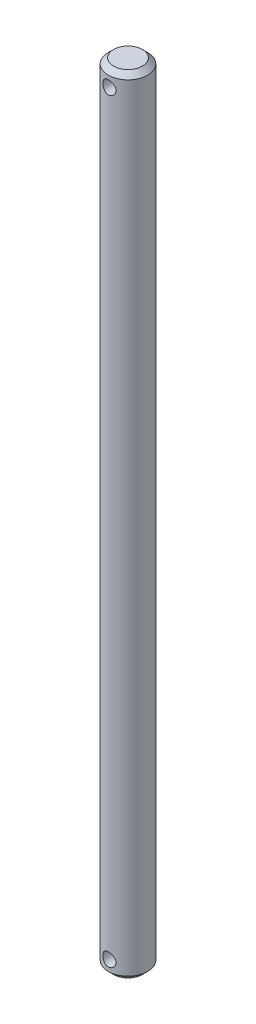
ISO-10303-21;
HEADER;
FILE_DESCRIPTION(('STEP AP214'),'2;1');
FILE_NAME('part.step','',(''),(''),'','','');
FILE_SCHEMA(('AUTOMOTIVE_DESIGN { 1 0 10303 214 1 1 1 1 }'));
ENDSEC;
DATA;
#1=APPLICATION_CONTEXT('core data for automotive mechanical design processes');
#2=APPLICATION_PROTOCOL_DEFINITION('international standard','automotive_design',2000,#1);
#3=PRODUCT_CONTEXT('',#1,'mechanical');
#4=PRODUCT('Part','Part','',(#3));
#5=PRODUCT_RELATED_PRODUCT_CATEGORY('part','',(#4));
#6=PRODUCT_DEFINITION_FORMATION('','',#4);
#7=PRODUCT_DEFINITION_CONTEXT('part definition',#1,'design');
#8=PRODUCT_DEFINITION('design','',#6,#7);
#9=PRODUCT_DEFINITION_SHAPE('','',#8);
#10=(LENGTH_UNIT() NAMED_UNIT(*) SI_UNIT(.MILLI.,.METRE.));
#11=(NAMED_UNIT(*) PLANE_ANGLE_UNIT() SI_UNIT($,.RADIAN.));
#12=(NAMED_UNIT(*) SI_UNIT($,.STERADIAN.) SOLID_ANGLE_UNIT());
#13=UNCERTAINTY_MEASURE_WITH_UNIT(LENGTH_MEASURE(1.E-05),#10,'distance_accuracy_value','');
#14=(GEOMETRIC_REPRESENTATION_CONTEXT(3) GLOBAL_UNCERTAINTY_ASSIGNED_CONTEXT((#13)) GLOBAL_UNIT_ASSIGNED_CONTEXT((#10,
#11,#12)) REPRESENTATION_CONTEXT('',''));
#15=CARTESIAN_POINT('',(0.,0.,0.));
#16=DIRECTION('',(0.,0.,1.));
#17=DIRECTION('',(1.,0.,0.));
#18=AXIS2_PLACEMENT_3D('',#15,#16,#17);
#19=CARTESIAN_POINT('',(0.,190.5,0.));
#20=DIRECTION('',(0.,-1.,0.));
#21=DIRECTION('',(0.,0.,-1.));
#22=AXIS2_PLACEMENT_3D('',#19,#20,#21);
#23=CYLINDRICAL_SURFACE('',#22,4.7625);
#24=CARTESIAN_POINT('',(0.,188.2775,-4.7625));
#25=CARTESIAN_POINT('',(-0.0866193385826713,188.277500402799,-4.76250024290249));
#26=CARTESIAN_POINT('',(-0.173236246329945,188.270387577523,-4.76011509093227));
#27=CARTESIAN_POINT('',(-0.343918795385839,188.242211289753,-4.75083521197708));
#28=CARTESIAN_POINT('',(-0.42798417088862,188.221146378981,-4.74394001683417));
#29=CARTESIAN_POINT('',(-0.591078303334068,188.165868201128,-4.72638926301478));
#30=CARTESIAN_POINT('',(-0.670115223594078,188.131676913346,-4.7157399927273));
#31=CARTESIAN_POINT('',(-0.82133271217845,188.051215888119,-4.6917680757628));
#32=CARTESIAN_POINT('',(-0.893511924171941,188.004943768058,-4.67844490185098));
#33=CARTESIAN_POINT('',(-1.03146490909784,187.899951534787,-4.65001124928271));
#34=CARTESIAN_POINT('',(-1.09696837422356,187.840887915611,-4.63485795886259));
#35=CARTESIAN_POINT('',(-1.21734689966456,187.712719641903,-4.60470749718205));
#36=CARTESIAN_POINT('',(-1.27221961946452,187.643612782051,-4.58971036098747));
#37=CARTESIAN_POINT('',(-1.37132209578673,187.494886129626,-4.56109915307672));
#38=CARTESIAN_POINT('',(-1.4152004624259,187.415021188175,-4.54753724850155));
#39=CARTESIAN_POINT('',(-1.48878746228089,187.248520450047,-4.52398297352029));
#40=CARTESIAN_POINT('',(-1.51850041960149,187.161886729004,-4.51398951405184));
#41=CARTESIAN_POINT('',(-1.5618991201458,186.987381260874,-4.49915443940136));
#42=CARTESIAN_POINT('',(-1.57609134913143,186.899649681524,-4.49415052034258));
#43=CARTESIAN_POINT('',(-1.58962903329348,186.722918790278,-4.48938104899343));
#44=CARTESIAN_POINT('',(-1.58897907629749,186.633919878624,-4.48961387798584));
#45=CARTESIAN_POINT('',(-1.57324409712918,186.46150059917,-4.49514936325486));
#46=CARTESIAN_POINT('',(-1.5588200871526,186.378011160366,-4.50021985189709));
#47=CARTESIAN_POINT('',(-1.51702478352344,186.214712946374,-4.51447944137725));
#48=CARTESIAN_POINT('',(-1.48965193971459,186.134904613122,-4.52366903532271));
#49=CARTESIAN_POINT('',(-1.42230325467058,185.979732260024,-4.54529683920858));
#50=CARTESIAN_POINT('',(-1.38213155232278,185.904460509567,-4.55778498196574));
#51=CARTESIAN_POINT('',(-1.29046145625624,185.761517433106,-4.58458186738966));
#52=CARTESIAN_POINT('',(-1.23895979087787,185.693848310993,-4.59889113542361));
#53=CARTESIAN_POINT('',(-1.12291706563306,185.56431708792,-4.62863135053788));
#54=CARTESIAN_POINT('',(-1.05783562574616,185.502942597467,-4.64408185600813));
#55=CARTESIAN_POINT('',(-0.918114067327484,185.391851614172,-4.67371014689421));
#56=CARTESIAN_POINT('',(-0.843473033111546,185.342136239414,-4.68788781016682));
#57=CARTESIAN_POINT('',(-0.685716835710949,185.255382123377,-4.71355908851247));
#58=CARTESIAN_POINT('',(-0.602524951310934,185.218474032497,-4.72502468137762));
#59=CARTESIAN_POINT('',(-0.430639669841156,185.159327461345,-4.7437765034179));
#60=CARTESIAN_POINT('',(-0.341948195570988,185.137083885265,-4.75106418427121));
#61=CARTESIAN_POINT('',(-0.165709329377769,185.108761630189,-4.76039857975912));
#62=CARTESIAN_POINT('',(-0.078278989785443,185.102024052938,-4.76265877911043));
#63=CARTESIAN_POINT('',(0.096480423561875,185.103028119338,-4.76232383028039));
#64=CARTESIAN_POINT('',(0.183809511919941,185.110767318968,-4.75972950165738));
#65=CARTESIAN_POINT('',(0.353250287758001,185.139983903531,-4.75011789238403));
#66=CARTESIAN_POINT('',(0.43543983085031,185.161056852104,-4.74323090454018));
#67=CARTESIAN_POINT('',(0.595083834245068,185.215837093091,-4.72585806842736));
#68=CARTESIAN_POINT('',(0.672537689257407,185.249545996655,-4.71537176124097));
#69=CARTESIAN_POINT('',(0.822782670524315,185.329624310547,-4.69152178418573));
#70=CARTESIAN_POINT('',(0.895397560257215,185.376303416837,-4.67808968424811));
#71=CARTESIAN_POINT('',(1.03197791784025,185.480633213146,-4.64987090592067));
#72=CARTESIAN_POINT('',(1.09594073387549,185.53828725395,-4.63508381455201));
#73=CARTESIAN_POINT('',(1.2164258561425,185.666028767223,-4.60496996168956));
#74=CARTESIAN_POINT('',(1.27247803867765,185.736562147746,-4.58964920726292));
#75=CARTESIAN_POINT('',(1.37200881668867,185.8863623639,-4.5608870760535));
#76=CARTESIAN_POINT('',(1.41548730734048,185.965629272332,-4.54744571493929));
#77=CARTESIAN_POINT('',(1.48843512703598,186.130680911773,-4.52409546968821));
#78=CARTESIAN_POINT('',(1.51793278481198,186.21645205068,-4.51417945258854));
#79=CARTESIAN_POINT('',(1.56193278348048,186.392151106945,-4.49914696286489));
#80=CARTESIAN_POINT('',(1.57644187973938,186.482077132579,-4.49402832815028));
#81=CARTESIAN_POINT('',(1.58952609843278,186.658562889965,-4.48941600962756));
#82=CARTESIAN_POINT('',(1.58888153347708,186.745058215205,-4.48964685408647));
#83=CARTESIAN_POINT('',(1.5735971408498,186.916639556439,-4.49502640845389));
#84=CARTESIAN_POINT('',(1.5589581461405,187.001725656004,-4.50017482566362));
#85=CARTESIAN_POINT('',(1.51665275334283,187.166465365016,-4.51460432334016));
#86=CARTESIAN_POINT('',(1.48923906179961,187.246191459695,-4.52380505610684));
#87=CARTESIAN_POINT('',(1.42236724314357,187.399973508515,-4.54527283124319));
#88=CARTESIAN_POINT('',(1.38290644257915,187.474028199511,-4.55754055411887));
#89=CARTESIAN_POINT('',(1.29105134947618,187.617867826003,-4.58442741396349));
#90=CARTESIAN_POINT('',(1.23816783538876,187.687325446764,-4.59912579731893));
#91=CARTESIAN_POINT('',(1.12179557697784,187.816632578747,-4.62888578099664));
#92=CARTESIAN_POINT('',(1.05830383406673,187.876479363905,-4.64394748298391));
#93=CARTESIAN_POINT('',(0.919545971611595,187.987216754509,-4.67344173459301));
#94=CARTESIAN_POINT('',(0.843917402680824,188.037667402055,-4.68782688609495));
#95=CARTESIAN_POINT('',(0.684779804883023,188.1250848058,-4.71370010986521));
#96=CARTESIAN_POINT('',(0.601272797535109,188.162055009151,-4.72518892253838));
#97=CARTESIAN_POINT('',(0.432583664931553,188.219908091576,-4.7435375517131));
#98=CARTESIAN_POINT('',(0.347643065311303,188.241435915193,-4.75058124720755));
#99=CARTESIAN_POINT('',(0.17513366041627,188.270229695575,-4.76006171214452));
#100=CARTESIAN_POINT('',(0.0875655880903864,188.277499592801,-4.76249975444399));
#101=CARTESIAN_POINT('',(0.,188.2775,-4.7625));
#102=B_SPLINE_CURVE_WITH_KNOTS('',3,(#24,#25,#26,#27,#28,#29,#30,#31,#32,#33,#34,#35,#36,#37,
#38,#39,#40,#41,#42,#43,#44,#45,#46,#47,#48,#49,#50,#51,#52,#53,#54,#55,#56,#57,#58,#59,#60,#61,
#62,#63,#64,#65,#66,#67,#68,#69,#70,#71,#72,#73,#74,#75,#76,#77,#78,#79,#80,#81,#82,#83,#84,#85,
#86,#87,#88,#89,#90,#91,#92,#93,#94,#95,#96,#97,#98,#99,#100,#101),.UNSPECIFIED.,.T.,.F.,(4,2,2,
2,2,2,2,2,2,2,2,2,2,2,2,2,2,2,2,2,2,2,2,2,2,2,2,2,2,2,2,2,2,2,2,2,2,2,4),(0.,0.259535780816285,
0.519098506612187,0.778228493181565,1.03740962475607,1.30468186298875,1.57201287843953,
1.84703060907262,2.12196433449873,2.3876305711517,2.65321468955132,2.90666212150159,
3.16013990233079,3.41769971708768,3.67533400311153,3.94641872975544,4.21752944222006,
4.49132968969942,4.76503474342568,5.02687563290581,5.28867232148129,5.54288575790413,
5.79713161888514,6.05806509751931,6.31907837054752,6.59195123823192,6.86482638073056,
7.13714621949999,7.4093432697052,7.66755619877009,7.92575375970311,8.1790474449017,
8.43239738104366,8.6968023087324,8.96128210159,9.23606961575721,9.51078681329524,
9.77323036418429,10.0356013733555),.UNSPECIFIED.);
#103=CARTESIAN_POINT('',(0.,188.2775,-4.7625));
#104=VERTEX_POINT('',#103);
#105=EDGE_CURVE('E10',#104,#104,#102,.T.);
#106=ORIENTED_EDGE('',*,*,#105,.T.);
#107=EDGE_LOOP('',(#106));
#108=FACE_BOUND('',#107,.T.);
#109=CARTESIAN_POINT('',(1.5875,186.69,4.49012806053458));
#110=CARTESIAN_POINT('',(1.58750040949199,186.603531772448,4.49012777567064));
#111=CARTESIAN_POINT('',(1.58041146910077,186.51706600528,4.49265308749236));
#112=CARTESIAN_POINT('',(1.55233867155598,186.346696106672,4.50242898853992));
#113=CARTESIAN_POINT('',(1.53135252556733,186.262792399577,4.50968035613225));
#114=CARTESIAN_POINT('',(1.47630433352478,186.100042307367,4.52799773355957));
#115=CARTESIAN_POINT('',(1.44226791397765,186.02118636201,4.53905626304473));
#116=CARTESIAN_POINT('',(1.36217283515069,185.87027842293,4.5637310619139));
#117=CARTESIAN_POINT('',(1.31611152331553,185.798227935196,4.57734789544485));
#118=CARTESIAN_POINT('',(1.21134369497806,185.660157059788,4.60620251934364));
#119=CARTESIAN_POINT('',(1.15224614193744,185.594441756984,4.62148070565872));
#120=CARTESIAN_POINT('',(1.02391792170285,185.473646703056,4.65159510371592));
#121=CARTESIAN_POINT('',(0.95468563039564,185.418568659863,4.66643124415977));
#122=CARTESIAN_POINT('',(0.805822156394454,185.319227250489,4.69445763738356));
#123=CARTESIAN_POINT('',(0.725966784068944,185.275283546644,4.70759484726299));
#124=CARTESIAN_POINT('',(0.559484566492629,185.20157335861,4.73026718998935));
#125=CARTESIAN_POINT('',(0.472859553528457,185.171803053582,4.73980329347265));
#126=CARTESIAN_POINT('',(0.298495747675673,185.128319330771,4.75391282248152));
#127=CARTESIAN_POINT('',(0.210900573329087,185.114083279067,4.75864737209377));
#128=CARTESIAN_POINT('',(0.0344453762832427,185.10041038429,4.76319228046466));
#129=CARTESIAN_POINT('',(-0.0544143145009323,185.100969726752,4.76300390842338));
#130=CARTESIAN_POINT('',(-0.227176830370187,185.116540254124,4.75783337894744));
#131=CARTESIAN_POINT('',(-0.311137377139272,185.130983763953,4.75303952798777));
#132=CARTESIAN_POINT('',(-0.47536645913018,185.172973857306,4.73943310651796));
#133=CARTESIAN_POINT('',(-0.555634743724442,185.20052132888,4.73062026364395));
#134=CARTESIAN_POINT('',(-0.711442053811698,185.268268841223,4.70972626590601));
#135=CARTESIAN_POINT('',(-0.786905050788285,185.308630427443,4.69760367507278));
#136=CARTESIAN_POINT('',(-0.93015486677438,185.400727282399,4.67135198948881));
#137=CARTESIAN_POINT('',(-0.997939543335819,185.452465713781,4.65722233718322));
#138=CARTESIAN_POINT('',(-1.12728512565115,185.568708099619,4.62766079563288));
#139=CARTESIAN_POINT('',(-1.18840274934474,185.63369838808,4.61219891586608));
#140=CARTESIAN_POINT('',(-1.29901514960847,185.773137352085,4.58227644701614));
#141=CARTESIAN_POINT('',(-1.34850813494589,185.84758748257,4.56781601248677));
#142=CARTESIAN_POINT('',(-1.43508008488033,186.005237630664,4.54136958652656));
#143=CARTESIAN_POINT('',(-1.47197201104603,186.088547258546,4.52942181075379));
#144=CARTESIAN_POINT('',(-1.53105356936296,186.260694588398,4.509796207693));
#145=CARTESIAN_POINT('',(-1.5532493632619,186.34952995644,4.50211659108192));
#146=CARTESIAN_POINT('',(-1.58140603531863,186.525913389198,4.49230172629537));
#147=CARTESIAN_POINT('',(-1.58805418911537,186.613338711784,4.48993197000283));
#148=CARTESIAN_POINT('',(-1.58687363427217,186.788069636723,4.49034966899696));
#149=CARTESIAN_POINT('',(-1.57904755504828,186.875375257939,4.49313618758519));
#150=CARTESIAN_POINT('',(-1.54975822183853,187.044261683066,4.50331868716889));
#151=CARTESIAN_POINT('',(-1.52877265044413,187.125936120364,4.51055304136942));
#152=CARTESIAN_POINT('',(-1.47433325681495,187.284587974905,4.52863828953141));
#153=CARTESIAN_POINT('',(-1.44087722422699,187.36156455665,4.53948982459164));
#154=CARTESIAN_POINT('',(-1.36124051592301,187.511341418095,4.56401293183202));
#155=CARTESIAN_POINT('',(-1.3146899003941,187.583931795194,4.57776303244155));
#156=CARTESIAN_POINT('',(-1.21060468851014,187.720519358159,4.60638157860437));
#157=CARTESIAN_POINT('',(-1.15306685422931,187.784514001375,4.62125035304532));
#158=CARTESIAN_POINT('',(-1.02535308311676,187.905275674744,4.65129623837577));
#159=CARTESIAN_POINT('',(-0.954702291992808,187.961546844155,4.66645376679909));
#160=CARTESIAN_POINT('',(-0.804588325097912,188.061466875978,4.69466376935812));
#161=CARTESIAN_POINT('',(-0.725125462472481,188.10511618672,4.70771631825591));
#162=CARTESIAN_POINT('',(-0.560038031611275,188.178154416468,4.73018494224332));
#163=CARTESIAN_POINT('',(-0.474457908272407,188.207636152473,4.73962460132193));
#164=CARTESIAN_POINT('',(-0.299177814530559,188.25166779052,4.75390544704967));
#165=CARTESIAN_POINT('',(-0.209479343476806,188.266223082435,4.75874829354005));
#166=CARTESIAN_POINT('',(-0.0330443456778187,188.279503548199,4.76316457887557));
#167=CARTESIAN_POINT('',(0.0536332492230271,188.278940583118,4.76297498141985));
#168=CARTESIAN_POINT('',(0.225601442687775,188.263756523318,4.75793111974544));
#169=CARTESIAN_POINT('',(0.310892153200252,188.249136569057,4.75307723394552));
#170=CARTESIAN_POINT('',(0.476316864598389,188.206725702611,4.7393370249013));
#171=CARTESIAN_POINT('',(0.556511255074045,188.179147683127,4.73051597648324));
#172=CARTESIAN_POINT('',(0.71116563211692,188.111800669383,4.70974992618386));
#173=CARTESIAN_POINT('',(0.785624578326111,188.072029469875,4.69780435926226));
#174=CARTESIAN_POINT('',(0.929694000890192,187.979733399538,4.67147066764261));
#175=CARTESIAN_POINT('',(0.999023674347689,187.926791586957,4.65700860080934));
#176=CARTESIAN_POINT('',(1.12804737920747,187.81036639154,4.62745119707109));
#177=CARTESIAN_POINT('',(1.18773832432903,187.746879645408,4.61235565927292));
#178=CARTESIAN_POINT('',(1.29816512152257,187.608195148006,4.58252956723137));
#179=CARTESIAN_POINT('',(1.34845895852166,187.532636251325,4.56783643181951));
#180=CARTESIAN_POINT('',(1.43559901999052,187.373681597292,4.54120556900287));
#181=CARTESIAN_POINT('',(1.47244875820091,187.290287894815,4.52926712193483));
#182=CARTESIAN_POINT('',(1.53010207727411,187.121860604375,4.51010868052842));
#183=CARTESIAN_POINT('',(1.55155568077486,187.037071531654,4.50269979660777));
#184=CARTESIAN_POINT('',(1.58025198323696,186.864853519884,4.49271046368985));
#185=CARTESIAN_POINT('',(1.58749958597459,186.777425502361,4.49012834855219));
#186=CARTESIAN_POINT('',(1.5875,186.69,4.49012806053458));
#187=B_SPLINE_CURVE_WITH_KNOTS('',3,(#109,#110,#111,#112,#113,#114,#115,#116,#117,#118,#119,
#120,#121,#122,#123,#124,#125,#126,#127,#128,#129,#130,#131,#132,#133,#134,#135,#136,#137,#138,
#139,#140,#141,#142,#143,#144,#145,#146,#147,#148,#149,#150,#151,#152,#153,#154,#155,#156,#157,
#158,#159,#160,#161,#162,#163,#164,#165,#166,#167,#168,#169,#170,#171,#172,#173,#174,#175,#176,
#177,#178,#179,#180,#181,#182,#183,#184,#185,#186),.UNSPECIFIED.,.T.,.F.,(4,2,2,2,2,2,2,2,2,2,2,
2,2,2,2,2,2,2,2,2,2,2,2,2,2,2,2,2,2,2,2,2,2,2,2,2,2,2,4),(0.,0.259080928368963,
0.518204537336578,0.776821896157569,1.03549635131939,1.30335873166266,1.5712640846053,
1.84615941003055,2.12098058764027,2.38623981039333,2.65143064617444,2.90622045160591,
3.16102752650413,3.41918377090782,3.6774118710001,3.94779776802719,4.21822530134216,
4.4925081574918,4.76667594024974,5.02847437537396,5.29022525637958,5.54298478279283,
5.79578913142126,6.05661186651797,6.31751158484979,6.5909635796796,6.86440586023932,
7.13603143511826,7.40755889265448,7.66632459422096,7.92506930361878,8.17970417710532,
8.43438513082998,8.69847637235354,8.96265200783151,9.23716883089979,9.51161385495,
9.7736534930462,10.0356026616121),.UNSPECIFIED.);
#188=CARTESIAN_POINT('',(1.5875,186.69,4.49012806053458));
#189=VERTEX_POINT('',#188);
#190=EDGE_CURVE('E44',#189,#189,#187,.T.);
#191=ORIENTED_EDGE('',*,*,#190,.T.);
#192=EDGE_LOOP('',(#191));
#193=FACE_BOUND('',#192,.T.);
#194=CARTESIAN_POINT('',(0.,5.39749999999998,-4.7625));
#195=CARTESIAN_POINT('',(-0.086619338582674,5.39750040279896,-4.76250024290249));
#196=CARTESIAN_POINT('',(-0.17323624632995,5.39038757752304,-4.76011509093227));
#197=CARTESIAN_POINT('',(-0.343918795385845,5.36221128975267,-4.75083521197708));
#198=CARTESIAN_POINT('',(-0.427984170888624,5.34114637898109,-4.74394001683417));
#199=CARTESIAN_POINT('',(-0.591078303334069,5.28586820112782,-4.72638926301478));
#200=CARTESIAN_POINT('',(-0.670115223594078,5.25167691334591,-4.7157399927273));
#201=CARTESIAN_POINT('',(-0.821332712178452,5.17121588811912,-4.6917680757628));
#202=CARTESIAN_POINT('',(-0.893511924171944,5.12494376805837,-4.67844490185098));
#203=CARTESIAN_POINT('',(-1.03146490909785,5.01995153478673,-4.65001124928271));
#204=CARTESIAN_POINT('',(-1.09696837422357,4.96088791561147,-4.63485795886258));
#205=CARTESIAN_POINT('',(-1.21734689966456,4.83271964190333,-4.60470749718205));
#206=CARTESIAN_POINT('',(-1.27221961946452,4.76361278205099,-4.58971036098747));
#207=CARTESIAN_POINT('',(-1.37132209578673,4.61488612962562,-4.56109915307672));
#208=CARTESIAN_POINT('',(-1.41520046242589,4.53502118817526,-4.54753724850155));
#209=CARTESIAN_POINT('',(-1.48878746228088,4.36852045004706,-4.52398297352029));
#210=CARTESIAN_POINT('',(-1.51850041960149,4.28188672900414,-4.51398951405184));
#211=CARTESIAN_POINT('',(-1.5618991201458,4.10738126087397,-4.49915443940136));
#212=CARTESIAN_POINT('',(-1.57609134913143,4.01964968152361,-4.49415052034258));
#213=CARTESIAN_POINT('',(-1.58962903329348,3.84291879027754,-4.48938104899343));
#214=CARTESIAN_POINT('',(-1.58897907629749,3.75391987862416,-4.48961387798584));
#215=CARTESIAN_POINT('',(-1.57324409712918,3.58150059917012,-4.49514936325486));
#216=CARTESIAN_POINT('',(-1.5588200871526,3.49801116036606,-4.50021985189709));
#217=CARTESIAN_POINT('',(-1.51702478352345,3.33471294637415,-4.51447944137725));
#218=CARTESIAN_POINT('',(-1.4896519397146,3.25490461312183,-4.52366903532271));
#219=CARTESIAN_POINT('',(-1.42230325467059,3.09973226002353,-4.54529683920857));
#220=CARTESIAN_POINT('',(-1.38213155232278,3.02446050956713,-4.55778498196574));
#221=CARTESIAN_POINT('',(-1.29046145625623,2.88151743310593,-4.58458186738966));
#222=CARTESIAN_POINT('',(-1.23895979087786,2.81384831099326,-4.59889113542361));
#223=CARTESIAN_POINT('',(-1.12291706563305,2.68431708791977,-4.62863135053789));
#224=CARTESIAN_POINT('',(-1.05783562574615,2.62294259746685,-4.64408185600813));
#225=CARTESIAN_POINT('',(-0.918114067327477,2.51185161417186,-4.67371014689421));
#226=CARTESIAN_POINT('',(-0.843473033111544,2.46213623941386,-4.68788781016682));
#227=CARTESIAN_POINT('',(-0.685716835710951,2.37538212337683,-4.71355908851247));
#228=CARTESIAN_POINT('',(-0.602524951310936,2.33847403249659,-4.72502468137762));
#229=CARTESIAN_POINT('',(-0.430639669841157,2.27932746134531,-4.7437765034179));
#230=CARTESIAN_POINT('',(-0.34194819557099,2.25708388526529,-4.75106418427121));
#231=CARTESIAN_POINT('',(-0.165709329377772,2.22876163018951,-4.76039857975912));
#232=CARTESIAN_POINT('',(-0.0782789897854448,2.22202405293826,-4.76265877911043));
#233=CARTESIAN_POINT('',(0.0964804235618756,2.22302811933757,-4.76232383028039));
#234=CARTESIAN_POINT('',(0.183809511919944,2.23076731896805,-4.75972950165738));
#235=CARTESIAN_POINT('',(0.353250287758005,2.25998390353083,-4.75011789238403));
#236=CARTESIAN_POINT('',(0.435439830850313,2.28105685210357,-4.74323090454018));
#237=CARTESIAN_POINT('',(0.595083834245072,2.33583709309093,-4.72585806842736));
#238=CARTESIAN_POINT('',(0.672537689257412,2.36954599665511,-4.71537176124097));
#239=CARTESIAN_POINT('',(0.82278267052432,2.44962431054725,-4.69152178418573));
#240=CARTESIAN_POINT('',(0.895397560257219,2.49630341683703,-4.6780896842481));
#241=CARTESIAN_POINT('',(1.03197791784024,2.6006332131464,-4.64987090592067));
#242=CARTESIAN_POINT('',(1.09594073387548,2.65828725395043,-4.63508381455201));
#243=CARTESIAN_POINT('',(1.2164258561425,2.78602876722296,-4.60496996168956));
#244=CARTESIAN_POINT('',(1.27247803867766,2.85656214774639,-4.58964920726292));
#245=CARTESIAN_POINT('',(1.37200881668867,3.00636236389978,-4.5608870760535));
#246=CARTESIAN_POINT('',(1.41548730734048,3.08562927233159,-4.54744571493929));
#247=CARTESIAN_POINT('',(1.48843512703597,3.25068091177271,-4.52409546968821));
#248=CARTESIAN_POINT('',(1.51793278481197,3.33645205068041,-4.51417945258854));
#249=CARTESIAN_POINT('',(1.56193278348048,3.51215110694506,-4.49914696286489));
#250=CARTESIAN_POINT('',(1.57644187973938,3.6020771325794,-4.49402832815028));
#251=CARTESIAN_POINT('',(1.58952609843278,3.77856288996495,-4.48941600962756));
#252=CARTESIAN_POINT('',(1.58888153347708,3.86505821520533,-4.48964685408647));
#253=CARTESIAN_POINT('',(1.5735971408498,4.03663955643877,-4.49502640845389));
#254=CARTESIAN_POINT('',(1.5589581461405,4.1217256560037,-4.50017482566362));
#255=CARTESIAN_POINT('',(1.51665275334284,4.28646536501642,-4.51460432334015));
#256=CARTESIAN_POINT('',(1.48923906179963,4.36619145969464,-4.52380505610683));
#257=CARTESIAN_POINT('',(1.4223672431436,4.5199735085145,-4.54527283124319));
#258=CARTESIAN_POINT('',(1.38290644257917,4.59402819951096,-4.55754055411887));
#259=CARTESIAN_POINT('',(1.2910513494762,4.73786782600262,-4.58442741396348));
#260=CARTESIAN_POINT('',(1.23816783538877,4.80732544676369,-4.59912579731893));
#261=CARTESIAN_POINT('',(1.12179557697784,4.93663257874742,-4.62888578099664));
#262=CARTESIAN_POINT('',(1.05830383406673,4.99647936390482,-4.64394748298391));
#263=CARTESIAN_POINT('',(0.919545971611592,5.10721675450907,-4.67344173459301));
#264=CARTESIAN_POINT('',(0.843917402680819,5.15766740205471,-4.68782688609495));
#265=CARTESIAN_POINT('',(0.684779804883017,5.2450848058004,-4.71370010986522));
#266=CARTESIAN_POINT('',(0.601272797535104,5.28205500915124,-4.72518892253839));
#267=CARTESIAN_POINT('',(0.432583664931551,5.33990809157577,-4.7435375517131));
#268=CARTESIAN_POINT('',(0.347643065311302,5.36143591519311,-4.75058124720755));
#269=CARTESIAN_POINT('',(0.17513366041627,5.39022969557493,-4.76006171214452));
#270=CARTESIAN_POINT('',(0.0875655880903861,5.39749959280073,-4.76249975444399));
#271=CARTESIAN_POINT('',(0.,5.39749999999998,-4.7625));
#272=B_SPLINE_CURVE_WITH_KNOTS('',3,(#194,#195,#196,#197,#198,#199,#200,#201,#202,#203,#204,
#205,#206,#207,#208,#209,#210,#211,#212,#213,#214,#215,#216,#217,#218,#219,#220,#221,#222,#223,
#224,#225,#226,#227,#228,#229,#230,#231,#232,#233,#234,#235,#236,#237,#238,#239,#240,#241,#242,
#243,#244,#245,#246,#247,#248,#249,#250,#251,#252,#253,#254,#255,#256,#257,#258,#259,#260,#261,
#262,#263,#264,#265,#266,#267,#268,#269,#270,#271),.UNSPECIFIED.,.T.,.F.,(4,2,2,2,2,2,2,2,2,2,2,
2,2,2,2,2,2,2,2,2,2,2,2,2,2,2,2,2,2,2,2,2,2,2,2,2,2,2,4),(0.,0.259535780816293,
0.519098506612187,0.778228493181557,1.03740962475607,1.30468186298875,1.57201287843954,
1.84703060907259,2.12196433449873,2.38763057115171,2.65321468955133,2.90666212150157,
3.16013990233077,3.4176997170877,3.67533400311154,3.94641872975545,4.21752944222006,
4.49132968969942,4.76503474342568,5.02687563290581,5.2886723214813,5.54288575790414,
5.79713161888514,6.05806509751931,6.31907837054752,6.59195123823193,6.86482638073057,
7.13714621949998,7.40934326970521,7.6675561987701,7.92575375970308,8.17904744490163,
8.43239738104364,8.6968023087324,8.96128210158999,9.23606961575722,9.51078681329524,
9.77323036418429,10.0356013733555),.UNSPECIFIED.);
#273=CARTESIAN_POINT('',(0.,5.39749999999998,-4.7625));
#274=VERTEX_POINT('',#273);
#275=EDGE_CURVE('E48',#274,#274,#272,.T.);
#276=ORIENTED_EDGE('',*,*,#275,.T.);
#277=EDGE_LOOP('',(#276));
#278=FACE_BOUND('',#277,.T.);
#279=CARTESIAN_POINT('',(1.5875,3.81,4.49012806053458));
#280=CARTESIAN_POINT('',(1.58750040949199,3.72353177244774,4.49012777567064));
#281=CARTESIAN_POINT('',(1.58041146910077,3.63706600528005,4.49265308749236));
#282=CARTESIAN_POINT('',(1.55233867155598,3.46669610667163,4.50242898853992));
#283=CARTESIAN_POINT('',(1.53135252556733,3.38279239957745,4.50968035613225));
#284=CARTESIAN_POINT('',(1.47630433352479,3.22004230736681,4.52799773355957));
#285=CARTESIAN_POINT('',(1.44226791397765,3.14118636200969,4.53905626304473));
#286=CARTESIAN_POINT('',(1.36217283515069,2.99027842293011,4.5637310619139));
#287=CARTESIAN_POINT('',(1.31611152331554,2.91822793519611,4.57734789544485));
#288=CARTESIAN_POINT('',(1.21134369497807,2.78015705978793,4.60620251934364));
#289=CARTESIAN_POINT('',(1.15224614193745,2.71444175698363,4.62148070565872));
#290=CARTESIAN_POINT('',(1.02391792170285,2.59364670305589,4.65159510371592));
#291=CARTESIAN_POINT('',(0.954685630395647,2.53856865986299,4.66643124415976));
#292=CARTESIAN_POINT('',(0.805822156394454,2.43922725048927,4.69445763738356));
#293=CARTESIAN_POINT('',(0.725966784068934,2.39528354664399,4.70759484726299));
#294=CARTESIAN_POINT('',(0.559484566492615,2.32157335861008,4.73026718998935));
#295=CARTESIAN_POINT('',(0.47285955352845,2.29180305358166,4.73980329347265));
#296=CARTESIAN_POINT('',(0.298495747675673,2.24831933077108,4.75391282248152));
#297=CARTESIAN_POINT('',(0.210900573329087,2.234083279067,4.75864737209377));
#298=CARTESIAN_POINT('',(0.0344453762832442,2.22041038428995,4.76319228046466));
#299=CARTESIAN_POINT('',(-0.0544143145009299,2.22096972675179,4.76300390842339));
#300=CARTESIAN_POINT('',(-0.227176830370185,2.23654025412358,4.75783337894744));
#301=CARTESIAN_POINT('',(-0.311137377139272,2.25098376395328,4.75303952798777));
#302=CARTESIAN_POINT('',(-0.47536645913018,2.29297385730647,4.73943310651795));
#303=CARTESIAN_POINT('',(-0.555634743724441,2.32052132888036,4.73062026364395));
#304=CARTESIAN_POINT('',(-0.711442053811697,2.38826884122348,4.70972626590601));
#305=CARTESIAN_POINT('',(-0.786905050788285,2.42863042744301,4.69760367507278));
#306=CARTESIAN_POINT('',(-0.930154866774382,2.52072728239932,4.67135198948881));
#307=CARTESIAN_POINT('',(-0.997939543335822,2.57246571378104,4.65722233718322));
#308=CARTESIAN_POINT('',(-1.12728512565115,2.68870809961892,4.62766079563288));
#309=CARTESIAN_POINT('',(-1.18840274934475,2.75369838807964,4.61219891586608));
#310=CARTESIAN_POINT('',(-1.29901514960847,2.89313735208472,4.58227644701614));
#311=CARTESIAN_POINT('',(-1.3485081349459,2.96758748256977,4.56781601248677));
#312=CARTESIAN_POINT('',(-1.43508008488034,3.12523763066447,4.54136958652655));
#313=CARTESIAN_POINT('',(-1.47197201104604,3.2085472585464,4.52942181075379));
#314=CARTESIAN_POINT('',(-1.53105356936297,3.38069458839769,4.50979620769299));
#315=CARTESIAN_POINT('',(-1.5532493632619,3.46952995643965,4.50211659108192));
#316=CARTESIAN_POINT('',(-1.58140603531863,3.64591338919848,4.49230172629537));
#317=CARTESIAN_POINT('',(-1.58805418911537,3.73333871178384,4.48993197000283));
#318=CARTESIAN_POINT('',(-1.58687363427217,3.9080696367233,4.49034966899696));
#319=CARTESIAN_POINT('',(-1.57904755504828,3.99537525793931,4.49313618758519));
#320=CARTESIAN_POINT('',(-1.54975822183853,4.16426168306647,4.50331868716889));
#321=CARTESIAN_POINT('',(-1.52877265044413,4.24593612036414,4.51055304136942));
#322=CARTESIAN_POINT('',(-1.47433325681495,4.40458797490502,4.52863828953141));
#323=CARTESIAN_POINT('',(-1.44087722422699,4.48156455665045,4.53948982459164));
#324=CARTESIAN_POINT('',(-1.361240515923,4.63134141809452,4.56401293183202));
#325=CARTESIAN_POINT('',(-1.3146899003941,4.70393179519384,4.57776303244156));
#326=CARTESIAN_POINT('',(-1.21060468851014,4.84051935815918,4.60638157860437));
#327=CARTESIAN_POINT('',(-1.15306685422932,4.90451400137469,4.62125035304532));
#328=CARTESIAN_POINT('',(-1.02535308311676,5.02527567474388,4.65129623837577));
#329=CARTESIAN_POINT('',(-0.95470229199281,5.08154684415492,4.66645376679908));
#330=CARTESIAN_POINT('',(-0.80458832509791,5.18146687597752,4.69466376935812));
#331=CARTESIAN_POINT('',(-0.725125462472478,5.22511618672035,4.70771631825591));
#332=CARTESIAN_POINT('',(-0.56003803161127,5.29815441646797,4.73018494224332));
#333=CARTESIAN_POINT('',(-0.474457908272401,5.32763615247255,4.73962460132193));
#334=CARTESIAN_POINT('',(-0.299177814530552,5.37166779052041,4.75390544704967));
#335=CARTESIAN_POINT('',(-0.2094793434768,5.3862230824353,4.75874829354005));
#336=CARTESIAN_POINT('',(-0.0330443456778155,5.39950354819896,4.76316457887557));
#337=CARTESIAN_POINT('',(0.0536332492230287,5.39894058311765,4.76297498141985));
#338=CARTESIAN_POINT('',(0.225601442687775,5.38375652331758,4.75793111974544));
#339=CARTESIAN_POINT('',(0.310892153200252,5.36913656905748,4.75307723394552));
#340=CARTESIAN_POINT('',(0.476316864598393,5.32672570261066,4.7393370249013));
#341=CARTESIAN_POINT('',(0.556511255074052,5.29914768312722,4.73051597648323));
#342=CARTESIAN_POINT('',(0.711165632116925,5.23180066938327,4.70974992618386));
#343=CARTESIAN_POINT('',(0.785624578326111,5.19202946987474,4.69780435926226));
#344=CARTESIAN_POINT('',(0.929694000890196,5.09973339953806,4.67147066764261));
#345=CARTESIAN_POINT('',(0.999023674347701,5.04679158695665,4.65700860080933));
#346=CARTESIAN_POINT('',(1.12804737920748,4.93036639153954,4.62745119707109));
#347=CARTESIAN_POINT('',(1.18773832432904,4.86687964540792,4.61235565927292));
#348=CARTESIAN_POINT('',(1.29816512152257,4.72819514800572,4.58252956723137));
#349=CARTESIAN_POINT('',(1.34845895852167,4.65263625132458,4.56783643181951));
#350=CARTESIAN_POINT('',(1.43559901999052,4.49368159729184,4.54120556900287));
#351=CARTESIAN_POINT('',(1.47244875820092,4.41028789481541,4.52926712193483));
#352=CARTESIAN_POINT('',(1.53010207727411,4.24186060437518,4.51010868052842));
#353=CARTESIAN_POINT('',(1.55155568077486,4.15707153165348,4.50269979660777));
#354=CARTESIAN_POINT('',(1.58025198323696,3.98485351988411,4.49271046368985));
#355=CARTESIAN_POINT('',(1.58749958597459,3.8974255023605,4.49012834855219));
#356=CARTESIAN_POINT('',(1.5875,3.81,4.49012806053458));
#357=B_SPLINE_CURVE_WITH_KNOTS('',3,(#279,#280,#281,#282,#283,#284,#285,#286,#287,#288,#289,
#290,#291,#292,#293,#294,#295,#296,#297,#298,#299,#300,#301,#302,#303,#304,#305,#306,#307,#308,
#309,#310,#311,#312,#313,#314,#315,#316,#317,#318,#319,#320,#321,#322,#323,#324,#325,#326,#327,
#328,#329,#330,#331,#332,#333,#334,#335,#336,#337,#338,#339,#340,#341,#342,#343,#344,#345,#346,
#347,#348,#349,#350,#351,#352,#353,#354,#355,#356),.UNSPECIFIED.,.T.,.F.,(4,2,2,2,2,2,2,2,2,2,2,
2,2,2,2,2,2,2,2,2,2,2,2,2,2,2,2,2,2,2,2,2,2,2,2,2,2,2,4),(0.,0.259080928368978,
0.518204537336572,0.776821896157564,1.03549635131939,1.30335873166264,1.57126408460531,
1.84615941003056,2.12098058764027,2.38623981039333,2.65143064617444,2.90622045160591,
3.16102752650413,3.41918377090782,3.6774118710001,3.94779776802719,4.21822530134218,
4.49250815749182,4.76667594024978,5.02847437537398,5.29022525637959,5.54298478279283,
5.79578913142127,6.05661186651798,6.31751158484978,6.5909635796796,6.86440586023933,
7.13603143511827,7.40755889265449,7.66632459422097,7.92506930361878,8.17970417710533,
8.43438513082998,8.69847637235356,8.96265200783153,9.2371688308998,9.51161385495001,
9.77365349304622,10.0356026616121),.UNSPECIFIED.);
#358=CARTESIAN_POINT('',(1.5875,3.81,4.49012806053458));
#359=VERTEX_POINT('',#358);
#360=EDGE_CURVE('E52',#359,#359,#357,.T.);
#361=ORIENTED_EDGE('',*,*,#360,.T.);
#362=EDGE_LOOP('',(#361));
#363=FACE_BOUND('',#362,.T.);
#364=CARTESIAN_POINT('',(0.,189.23,0.));
#365=DIRECTION('',(0.,1.,0.));
#366=DIRECTION('',(0.,0.,1.));
#367=AXIS2_PLACEMENT_3D('',#364,#365,#366);
#368=CIRCLE('',#367,4.7625);
#369=CARTESIAN_POINT('',(0.,189.23,4.7625));
#370=VERTEX_POINT('',#369);
#371=EDGE_CURVE('E80',#370,#370,#368,.F.);
#372=ORIENTED_EDGE('',*,*,#371,.T.);
#373=EDGE_LOOP('',(#372));
#374=FACE_BOUND('',#373,.T.);
#375=CARTESIAN_POINT('',(0.,1.26999999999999,0.));
#376=DIRECTION('',(0.,1.,0.));
#377=DIRECTION('',(0.,0.,1.));
#378=AXIS2_PLACEMENT_3D('',#375,#376,#377);
#379=CIRCLE('',#378,4.7625);
#380=CARTESIAN_POINT('',(0.,1.26999999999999,4.7625));
#381=VERTEX_POINT('',#380);
#382=EDGE_CURVE('E83',#381,#381,#379,.T.);
#383=ORIENTED_EDGE('',*,*,#382,.T.);
#384=EDGE_LOOP('',(#383));
#385=FACE_BOUND('',#384,.T.);
#386=ADVANCED_FACE('F34',(#108,#193,#278,#363,#374,#385),#23,.T.);
#387=CARTESIAN_POINT('',(0.,190.5,0.));
#388=DIRECTION('',(0.,1.,0.));
#389=DIRECTION('',(0.,0.,1.));
#390=AXIS2_PLACEMENT_3D('',#387,#388,#389);
#391=PLANE('',#390);
#392=CARTESIAN_POINT('',(0.,190.5,0.));
#393=DIRECTION('',(0.,1.,0.));
#394=DIRECTION('',(0.,0.,1.));
#395=AXIS2_PLACEMENT_3D('',#392,#393,#394);
#396=CIRCLE('',#395,3.49250000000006);
#397=CARTESIAN_POINT('',(0.,190.5,3.49250000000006));
#398=VERTEX_POINT('',#397);
#399=EDGE_CURVE('E86',#398,#398,#396,.T.);
#400=ORIENTED_EDGE('',*,*,#399,.T.);
#401=EDGE_LOOP('',(#400));
#402=FACE_BOUND('',#401,.T.);
#403=ADVANCED_FACE('F90',(#402),#391,.T.);
#404=CARTESIAN_POINT('',(0.,0.,0.));
#405=DIRECTION('',(0.,1.,0.));
#406=DIRECTION('',(0.,0.,1.));
#407=AXIS2_PLACEMENT_3D('',#404,#405,#406);
#408=PLANE('',#407);
#409=CARTESIAN_POINT('',(0.,0.,0.));
#410=DIRECTION('',(0.,1.,0.));
#411=DIRECTION('',(0.,0.,1.));
#412=AXIS2_PLACEMENT_3D('',#409,#410,#411);
#413=CIRCLE('',#412,3.49249999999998);
#414=CARTESIAN_POINT('',(0.,0.,3.49249999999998));
#415=VERTEX_POINT('',#414);
#416=EDGE_CURVE('E77',#415,#415,#413,.F.);
#417=ORIENTED_EDGE('',*,*,#416,.T.);
#418=EDGE_LOOP('',(#417));
#419=FACE_BOUND('',#418,.T.);
#420=ADVANCED_FACE('F94',(#419),#408,.F.);
#421=CARTESIAN_POINT('',(0.,190.5,0.));
#422=DIRECTION('',(0.,-1.,0.));
#423=DIRECTION('',(0.,0.,-1.));
#424=AXIS2_PLACEMENT_3D('',#421,#422,#423);
#425=CONICAL_SURFACE('',#424,3.49250000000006,0.785398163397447);
#426=ORIENTED_EDGE('',*,*,#371,.F.);
#427=EDGE_LOOP('',(#426));
#428=FACE_BOUND('',#427,.T.);
#429=ORIENTED_EDGE('',*,*,#399,.F.);
#430=EDGE_LOOP('',(#429));
#431=FACE_BOUND('',#430,.T.);
#432=ADVANCED_FACE('F92',(#428,#431),#425,.T.);
#433=CARTESIAN_POINT('',(0.,1.26999999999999,0.));
#434=DIRECTION('',(0.,1.,0.));
#435=DIRECTION('',(0.,0.,1.));
#436=AXIS2_PLACEMENT_3D('',#433,#434,#435);
#437=CONICAL_SURFACE('',#436,4.7625,0.785398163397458);
#438=ORIENTED_EDGE('',*,*,#416,.F.);
#439=EDGE_LOOP('',(#438));
#440=FACE_BOUND('',#439,.T.);
#441=ORIENTED_EDGE('',*,*,#382,.F.);
#442=EDGE_LOOP('',(#441));
#443=FACE_BOUND('',#442,.T.);
#444=ADVANCED_FACE('F69',(#440,#443),#437,.T.);
#445=CARTESIAN_POINT('',(0.,3.81,-4.7625));
#446=DIRECTION('',(0.,0.,1.));
#447=DIRECTION('',(1.,0.,0.));
#448=AXIS2_PLACEMENT_3D('',#445,#446,#447);
#449=CYLINDRICAL_SURFACE('',#448,1.5875);
#450=ORIENTED_EDGE('',*,*,#360,.F.);
#451=EDGE_LOOP('',(#450));
#452=FACE_BOUND('',#451,.T.);
#453=ORIENTED_EDGE('',*,*,#275,.F.);
#454=EDGE_LOOP('',(#453));
#455=FACE_BOUND('',#454,.T.);
#456=ADVANCED_FACE('F63',(#452,#455),#449,.F.);
#457=CARTESIAN_POINT('',(0.,186.69,-4.7625));
#458=DIRECTION('',(0.,0.,1.));
#459=DIRECTION('',(1.,0.,0.));
#460=AXIS2_PLACEMENT_3D('',#457,#458,#459);
#461=CYLINDRICAL_SURFACE('',#460,1.5875);
#462=ORIENTED_EDGE('',*,*,#190,.F.);
#463=EDGE_LOOP('',(#462));
#464=FACE_BOUND('',#463,.T.);
#465=ORIENTED_EDGE('',*,*,#105,.F.);
#466=EDGE_LOOP('',(#465));
#467=FACE_BOUND('',#466,.T.);
#468=ADVANCED_FACE('F60',(#464,#467),#461,.F.);
#469=CLOSED_SHELL('',(#386,#403,#420,#432,#444,#456,#468));
#470=MANIFOLD_SOLID_BREP('B2',#469);
#471=ADVANCED_BREP_SHAPE_REPRESENTATION('',(#18,#470),#14);
#472=SHAPE_DEFINITION_REPRESENTATION(#9,#471);
ENDSEC;
END-ISO-10303-21;
